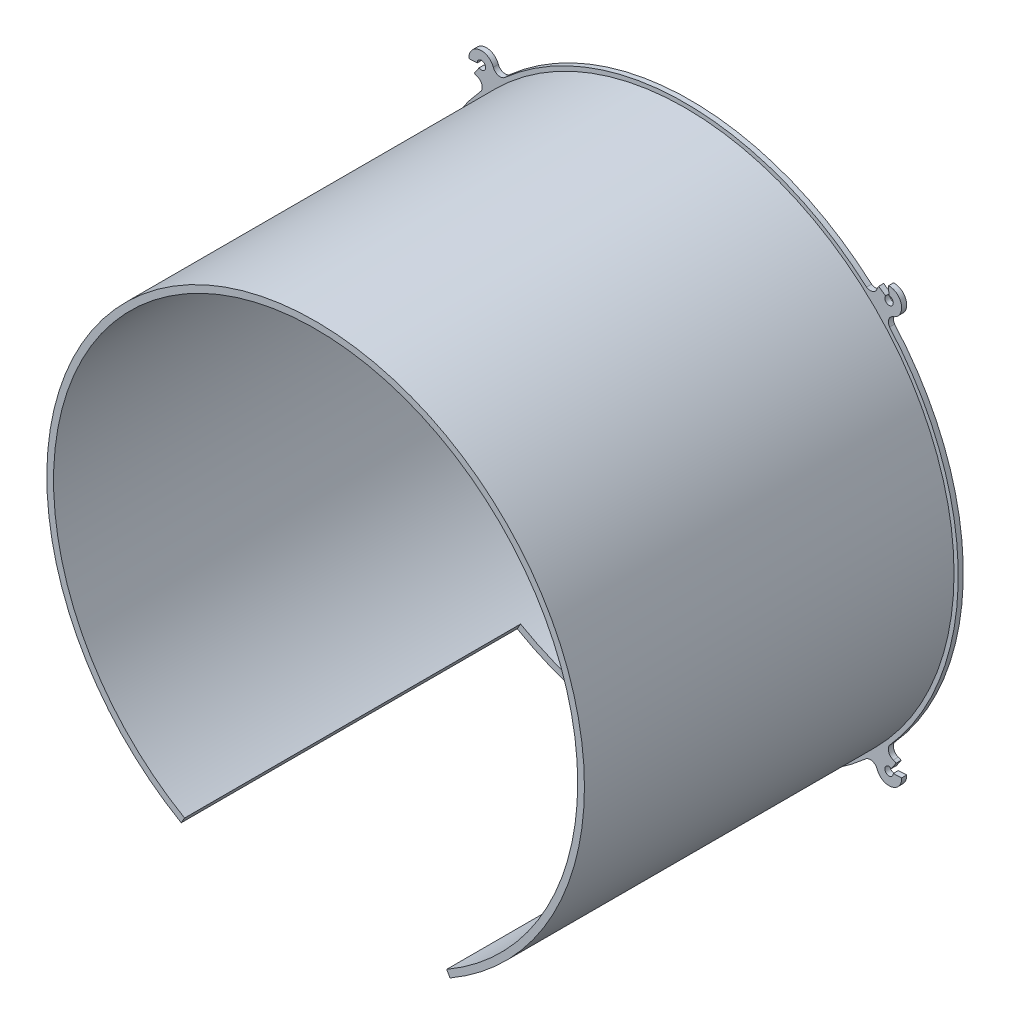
from build123d import *

# Parameters (mm, degrees)
CROQUIS1_R                   = 159.276931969
SALIENTE_EXTRUIR1_DEPTH      = 3
SALIENTE_EXTRUIR2_DEPTH      = 220
SALIENTE_EXTRUIR2_DEPTH_BACK = 3
CROQUIS2_R                   = 160
CROQUIS2_R_2                 = 156
CORTAR_EXTRUIR1_START        = -200
CORTAR_EXTRUIR1_DEPTH        = 200


with BuildPart() as part:
    # Croquis1 → Saliente-Extruir1 (new body)
    with BuildSketch(Plane.XY):
        with BuildLine():
            Line((121.212755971, 123.814457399), (121.005036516, 128.810140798))
            ThreePointArc((121.005036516, 128.810140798), (128.680751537, 122.73770801), (123.815697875, 114.245223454))
            ThreePointArc((123.815697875, 114.245223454), (121.144061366, 111.532166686), (121.634116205, 107.756168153))
            ThreePointArc((121.634116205, 107.756168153), (162.499968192, -0.101674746), (121.499176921, -107.908294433))
            ThreePointArc((121.499176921, -107.908294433), (121.133545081, -111.633831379), (123.815697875, -114.245223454))
            ThreePointArc((123.815697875, -114.245223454), (124.694535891, -114.62037383), (125.518540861, -115.104222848))
            Line((125.518540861, -115.104222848), (122.71725742, -119.245818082))
            ThreePointArc((122.71725742, -119.245818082), (119.133325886, -122.534501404), (123.814457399, -121.212755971))
            Line((123.814457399, -121.212755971), (128.810140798, -121.005036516))
            ThreePointArc((128.810140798, -121.005036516), (122.73770801, -128.680751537), (114.245223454, -123.815697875))
            ThreePointArc((114.245223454, -123.815697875), (111.532166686, -121.144061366), (107.756168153, -121.634116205))
            ThreePointArc((107.756168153, -121.634116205), (-0.101674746, -162.499968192), (-107.908294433, -121.499176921))
            ThreePointArc((-107.908294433, -121.499176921), (-111.633831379, -121.133545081), (-114.245223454, -123.815697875))
            ThreePointArc((-114.245223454, -123.815697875), (-114.62037383, -124.694535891), (-115.104222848, -125.518540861))
            Line((-115.104222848, -125.518540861), (-119.245818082, -122.71725742))
            ThreePointArc((-119.245818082, -122.71725742), (-122.534501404, -119.133325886), (-121.212755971, -123.814457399))
            Line((-121.212755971, -123.814457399), (-121.005036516, -128.810140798))
            ThreePointArc((-121.005036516, -128.810140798), (-128.680751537, -122.73770801), (-123.815697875, -114.245223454))
            ThreePointArc((-123.815697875, -114.245223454), (-121.144061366, -111.532166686), (-121.634116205, -107.756168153))
            ThreePointArc((-121.634116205, -107.756168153), (-162.499968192, 0.101674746), (-121.499176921, 107.908294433))
            ThreePointArc((-121.499176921, 107.908294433), (-121.133545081, 111.633831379), (-123.815697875, 114.245223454))
            ThreePointArc((-123.815697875, 114.245223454), (-124.694535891, 114.62037383), (-125.518540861, 115.104222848))
            Line((-125.518540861, 115.104222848), (-122.71725742, 119.245818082))
            ThreePointArc((-122.71725742, 119.245818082), (-119.133325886, 122.534501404), (-123.814457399, 121.212755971))
            Line((-123.814457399, 121.212755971), (-128.810140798, 121.005036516))
            ThreePointArc((-128.810140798, 121.005036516), (-122.73770801, 128.680751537), (-114.245223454, 123.815697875))
            ThreePointArc((-114.245223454, 123.815697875), (-111.532166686, 121.144061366), (-107.756168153, 121.634116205))
            ThreePointArc((-107.756168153, 121.634116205), (0.101674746, 162.499968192), (107.908294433, 121.499176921))
            ThreePointArc((107.908294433, 121.499176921), (111.633831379, 121.133545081), (114.245223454, 123.815697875))
            ThreePointArc((114.245223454, 123.815697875), (114.62037383, 124.694535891), (115.104222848, 125.518540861))
            Line((115.104222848, 125.518540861), (119.245818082, 122.71725742))
            ThreePointArc((119.245818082, 122.71725742), (122.534501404, 119.133325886), (121.212755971, 123.814457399))
        make_face()
        Circle(CROQUIS1_R, mode=Mode.SUBTRACT)
    extrude(amount=SALIENTE_EXTRUIR1_DEPTH)

    # Croquis2 → Saliente-Extruir2 (add, two sides: drawn at the far end of the back side and taken through both)
    with BuildSketch(Plane.XY.offset(3).offset(-SALIENTE_EXTRUIR2_DEPTH_BACK)):
        Circle(CROQUIS2_R)
        Circle(CROQUIS2_R_2, mode=Mode.SUBTRACT)
    extrude(amount=SALIENTE_EXTRUIR2_DEPTH + SALIENTE_EXTRUIR2_DEPTH_BACK)

    # Croquis3 → Cortar-Extruir1 (cut)
    with BuildSketch(Plane.XY.offset(223).offset(CORTAR_EXTRUIR1_START)):
        with BuildLine():
            Line((0, 0), (-80, -138.564064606))
            ThreePointArc((-80, -138.564064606), (0, -160), (80, -138.564064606))
            Line((80, -138.564064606), (0, 0))
        make_face()
    extrude(amount=CORTAR_EXTRUIR1_DEPTH, mode=Mode.SUBTRACT)


solid = part.part
